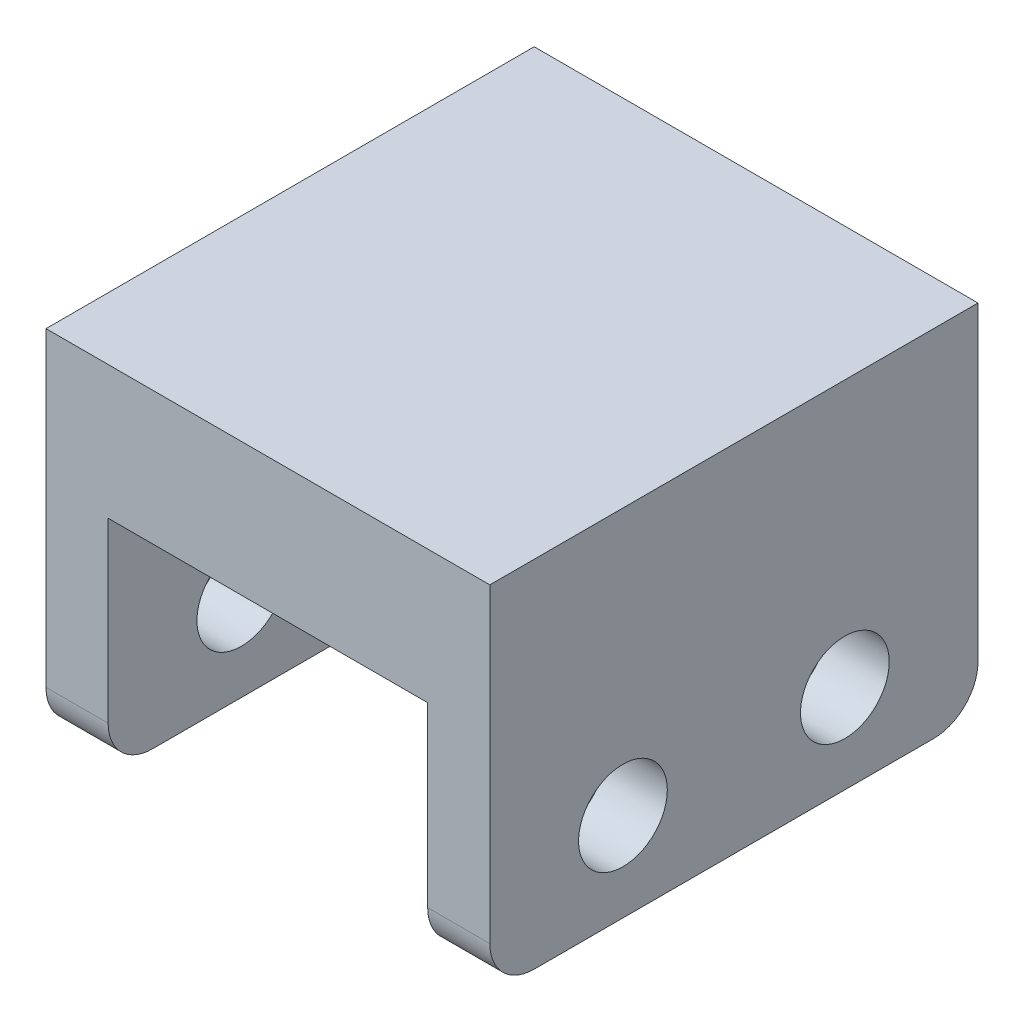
from build123d import *

# Parameters (mm, degrees)
SKETCH1_W           = 50
SKETCH1_H           = 55
BOSS_EXTRUDE1_DEPTH = 40
FILLET1_R           = 5
SKETCH2_W           = 36
SKETCH2_H           = 55
CUT_EXTRUDE1_DEPTH  = 25
SKETCH3_R           = 5
CUT_EXTRUDE2_DEPTH  = 61


with BuildPart() as part:
    # Sketch1 → Boss-Extrude1 (new body)
    with BuildSketch(Plane(origin=(0, 0, 0), x_dir=(1, 0, 0), z_dir=(0, 1, 0))):
        Rectangle(SKETCH1_W, SKETCH1_H)
    extrude(amount=BOSS_EXTRUDE1_DEPTH)

    # Fillet1
    fillet1_edges = [part.edges().sort_by_distance(p)[0] for p in [
        (0, 0, 27.5),
        (0, 0, -27.5),
    ]]
    fillet(fillet1_edges, radius=FILLET1_R)

    # Sketch2 → Cut-Extrude1 (cut)
    with BuildSketch(Plane.XZ):
        Rectangle(SKETCH2_W, SKETCH2_H)
    extrude(amount=-CUT_EXTRUDE1_DEPTH, mode=Mode.SUBTRACT)

    # Sketch3 → Cut-Extrude2 (cut)
    with BuildSketch(Plane(origin=(25, 0, 0), x_dir=(0, 0, -1), z_dir=(1, 0, 0))):
        with Locations((-12.5, 10)):
            Circle(SKETCH3_R)
        with Locations((12.5, 10)):
            Circle(SKETCH3_R)
    extrude(amount=-CUT_EXTRUDE2_DEPTH, mode=Mode.SUBTRACT)


solid = part.part
